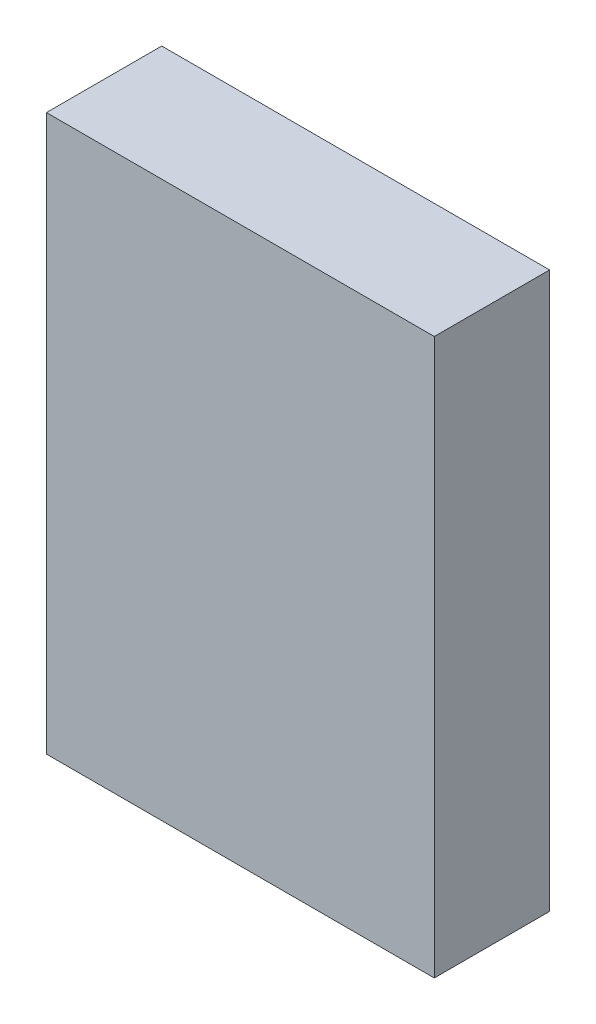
ISO-10303-21;
HEADER;
FILE_DESCRIPTION(('STEP AP214'),'2;1');
FILE_NAME('part.step','',(''),(''),'','','');
FILE_SCHEMA(('AUTOMOTIVE_DESIGN { 1 0 10303 214 1 1 1 1 }'));
ENDSEC;
DATA;
#1=APPLICATION_CONTEXT('core data for automotive mechanical design processes');
#2=APPLICATION_PROTOCOL_DEFINITION('international standard','automotive_design',2000,#1);
#3=PRODUCT_CONTEXT('',#1,'mechanical');
#4=PRODUCT('Part','Part','',(#3));
#5=PRODUCT_RELATED_PRODUCT_CATEGORY('part','',(#4));
#6=PRODUCT_DEFINITION_FORMATION('','',#4);
#7=PRODUCT_DEFINITION_CONTEXT('part definition',#1,'design');
#8=PRODUCT_DEFINITION('design','',#6,#7);
#9=PRODUCT_DEFINITION_SHAPE('','',#8);
#10=(LENGTH_UNIT() NAMED_UNIT(*) SI_UNIT(.MILLI.,.METRE.));
#11=(NAMED_UNIT(*) PLANE_ANGLE_UNIT() SI_UNIT($,.RADIAN.));
#12=(NAMED_UNIT(*) SI_UNIT($,.STERADIAN.) SOLID_ANGLE_UNIT());
#13=UNCERTAINTY_MEASURE_WITH_UNIT(LENGTH_MEASURE(1.E-05),#10,'distance_accuracy_value','');
#14=(GEOMETRIC_REPRESENTATION_CONTEXT(3) GLOBAL_UNCERTAINTY_ASSIGNED_CONTEXT((#13)) GLOBAL_UNIT_ASSIGNED_CONTEXT((#10,
#11,#12)) REPRESENTATION_CONTEXT('',''));
#15=CARTESIAN_POINT('',(0.,0.,0.));
#16=DIRECTION('',(0.,0.,1.));
#17=DIRECTION('',(1.,0.,0.));
#18=AXIS2_PLACEMENT_3D('',#15,#16,#17);
#19=CARTESIAN_POINT('',(0.,1.270000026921E-06,0.5499989));
#20=DIRECTION('',(0.,0.,-1.));
#21=DIRECTION('',(0.,-1.,0.));
#22=AXIS2_PLACEMENT_3D('',#19,#20,#21);
#23=PLANE('',#22);
#24=DIRECTION('',(1.,0.,0.));
#25=VECTOR('',#24,1.);
#26=CARTESIAN_POINT('',(-0.92499942,1.32500116,0.5499989));
#27=LINE('',#26,#25);
#28=CARTESIAN_POINT('',(-0.92499942,1.32500116,0.5499989));
#29=VERTEX_POINT('',#28);
#30=CARTESIAN_POINT('',(0.92499942,1.32500116,0.5499989));
#31=VERTEX_POINT('',#30);
#32=EDGE_CURVE('E26',#29,#31,#27,.T.);
#33=ORIENTED_EDGE('',*,*,#32,.F.);
#34=DIRECTION('',(0.,1.,0.));
#35=VECTOR('',#34,1.);
#36=CARTESIAN_POINT('',(-0.92499942,-1.32499862,0.5499989));
#37=LINE('',#36,#35);
#38=CARTESIAN_POINT('',(-0.92499942,-1.32499862,0.5499989));
#39=VERTEX_POINT('',#38);
#40=EDGE_CURVE('E97',#39,#29,#37,.T.);
#41=ORIENTED_EDGE('',*,*,#40,.F.);
#42=DIRECTION('',(-1.,0.,0.));
#43=VECTOR('',#42,1.);
#44=CARTESIAN_POINT('',(0.92499942,-1.32499862,0.5499989));
#45=LINE('',#44,#43);
#46=CARTESIAN_POINT('',(0.92499942,-1.32499862,0.5499989));
#47=VERTEX_POINT('',#46);
#48=EDGE_CURVE('E83',#47,#39,#45,.T.);
#49=ORIENTED_EDGE('',*,*,#48,.F.);
#50=DIRECTION('',(0.,-1.,0.));
#51=VECTOR('',#50,1.);
#52=CARTESIAN_POINT('',(0.92499942,1.32500116,0.5499989));
#53=LINE('',#52,#51);
#54=EDGE_CURVE('E87',#31,#47,#53,.T.);
#55=ORIENTED_EDGE('',*,*,#54,.F.);
#56=EDGE_LOOP('',(#33,#41,#49,#55));
#57=FACE_BOUND('',#56,.T.);
#58=ADVANCED_FACE('F17',(#57),#23,.F.);
#59=CARTESIAN_POINT('',(0.,1.270000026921E-06,0.));
#60=DIRECTION('',(0.,0.,-1.));
#61=DIRECTION('',(0.,-1.,0.));
#62=AXIS2_PLACEMENT_3D('',#59,#60,#61);
#63=PLANE('',#62);
#64=DIRECTION('',(0.,-1.,0.));
#65=VECTOR('',#64,1.);
#66=CARTESIAN_POINT('',(0.92499942,1.32500116,0.));
#67=LINE('',#66,#65);
#68=CARTESIAN_POINT('',(0.92499942,1.32500116,0.));
#69=VERTEX_POINT('',#68);
#70=CARTESIAN_POINT('',(0.92499942,-1.32499862,0.));
#71=VERTEX_POINT('',#70);
#72=EDGE_CURVE('E71',#69,#71,#67,.T.);
#73=ORIENTED_EDGE('',*,*,#72,.T.);
#74=DIRECTION('',(-1.,0.,0.));
#75=VECTOR('',#74,1.);
#76=CARTESIAN_POINT('',(0.92499942,-1.32499862,0.));
#77=LINE('',#76,#75);
#78=CARTESIAN_POINT('',(-0.92499942,-1.32499862,0.));
#79=VERTEX_POINT('',#78);
#80=EDGE_CURVE('E101',#71,#79,#77,.T.);
#81=ORIENTED_EDGE('',*,*,#80,.T.);
#82=DIRECTION('',(0.,1.,0.));
#83=VECTOR('',#82,1.);
#84=CARTESIAN_POINT('',(-0.92499942,-1.32499862,0.));
#85=LINE('',#84,#83);
#86=CARTESIAN_POINT('',(-0.92499942,1.32500116,0.));
#87=VERTEX_POINT('',#86);
#88=EDGE_CURVE('E73',#79,#87,#85,.T.);
#89=ORIENTED_EDGE('',*,*,#88,.T.);
#90=DIRECTION('',(1.,0.,0.));
#91=VECTOR('',#90,1.);
#92=CARTESIAN_POINT('',(-0.92499942,1.32500116,0.));
#93=LINE('',#92,#91);
#94=EDGE_CURVE('E11',#87,#69,#93,.T.);
#95=ORIENTED_EDGE('',*,*,#94,.T.);
#96=EDGE_LOOP('',(#73,#81,#89,#95));
#97=FACE_BOUND('',#96,.T.);
#98=ADVANCED_FACE('F19',(#97),#63,.T.);
#99=CARTESIAN_POINT('',(-0.92499942,1.32500116,0.));
#100=DIRECTION('',(0.,1.,0.));
#101=DIRECTION('',(1.,0.,0.));
#102=AXIS2_PLACEMENT_3D('',#99,#100,#101);
#103=PLANE('',#102);
#104=DIRECTION('',(0.,0.,1.));
#105=VECTOR('',#104,1.);
#106=CARTESIAN_POINT('',(-0.92499942,1.32500116,0.));
#107=LINE('',#106,#105);
#108=EDGE_CURVE('E100',#87,#29,#107,.T.);
#109=ORIENTED_EDGE('',*,*,#108,.T.);
#110=ORIENTED_EDGE('',*,*,#32,.T.);
#111=DIRECTION('',(0.,0.,1.));
#112=VECTOR('',#111,1.);
#113=CARTESIAN_POINT('',(0.92499942,1.32500116,0.));
#114=LINE('',#113,#112);
#115=EDGE_CURVE('E79',#69,#31,#114,.T.);
#116=ORIENTED_EDGE('',*,*,#115,.F.);
#117=ORIENTED_EDGE('',*,*,#94,.F.);
#118=EDGE_LOOP('',(#109,#110,#116,#117));
#119=FACE_BOUND('',#118,.T.);
#120=ADVANCED_FACE('F85',(#119),#103,.T.);
#121=CARTESIAN_POINT('',(-0.92499942,-1.32499862,0.));
#122=DIRECTION('',(-1.,0.,0.));
#123=DIRECTION('',(0.,0.,1.));
#124=AXIS2_PLACEMENT_3D('',#121,#122,#123);
#125=PLANE('',#124);
#126=DIRECTION('',(0.,0.,1.));
#127=VECTOR('',#126,1.);
#128=CARTESIAN_POINT('',(-0.92499942,-1.32499862,0.));
#129=LINE('',#128,#127);
#130=EDGE_CURVE('E108',#79,#39,#129,.T.);
#131=ORIENTED_EDGE('',*,*,#130,.T.);
#132=ORIENTED_EDGE('',*,*,#40,.T.);
#133=ORIENTED_EDGE('',*,*,#108,.F.);
#134=ORIENTED_EDGE('',*,*,#88,.F.);
#135=EDGE_LOOP('',(#131,#132,#133,#134));
#136=FACE_BOUND('',#135,.T.);
#137=ADVANCED_FACE('F119',(#136),#125,.T.);
#138=CARTESIAN_POINT('',(0.92499942,-1.32499862,0.));
#139=DIRECTION('',(0.,-1.,0.));
#140=DIRECTION('',(0.,0.,-1.));
#141=AXIS2_PLACEMENT_3D('',#138,#139,#140);
#142=PLANE('',#141);
#143=DIRECTION('',(0.,0.,1.));
#144=VECTOR('',#143,1.);
#145=CARTESIAN_POINT('',(0.92499942,-1.32499862,0.));
#146=LINE('',#145,#144);
#147=EDGE_CURVE('E81',#71,#47,#146,.T.);
#148=ORIENTED_EDGE('',*,*,#147,.T.);
#149=ORIENTED_EDGE('',*,*,#48,.T.);
#150=ORIENTED_EDGE('',*,*,#130,.F.);
#151=ORIENTED_EDGE('',*,*,#80,.F.);
#152=EDGE_LOOP('',(#148,#149,#150,#151));
#153=FACE_BOUND('',#152,.T.);
#154=ADVANCED_FACE('F122',(#153),#142,.T.);
#155=CARTESIAN_POINT('',(0.92499942,1.32500116,0.));
#156=DIRECTION('',(1.,0.,0.));
#157=DIRECTION('',(0.,1.,0.));
#158=AXIS2_PLACEMENT_3D('',#155,#156,#157);
#159=PLANE('',#158);
#160=ORIENTED_EDGE('',*,*,#115,.T.);
#161=ORIENTED_EDGE('',*,*,#54,.T.);
#162=ORIENTED_EDGE('',*,*,#147,.F.);
#163=ORIENTED_EDGE('',*,*,#72,.F.);
#164=EDGE_LOOP('',(#160,#161,#162,#163));
#165=FACE_BOUND('',#164,.T.);
#166=ADVANCED_FACE('F77',(#165),#159,.T.);
#167=CLOSED_SHELL('',(#58,#98,#120,#137,#154,#166));
#168=MANIFOLD_SOLID_BREP('B1',#167);
#169=ADVANCED_BREP_SHAPE_REPRESENTATION('',(#18,#168),#14);
#170=SHAPE_DEFINITION_REPRESENTATION(#9,#169);
ENDSEC;
END-ISO-10303-21;
